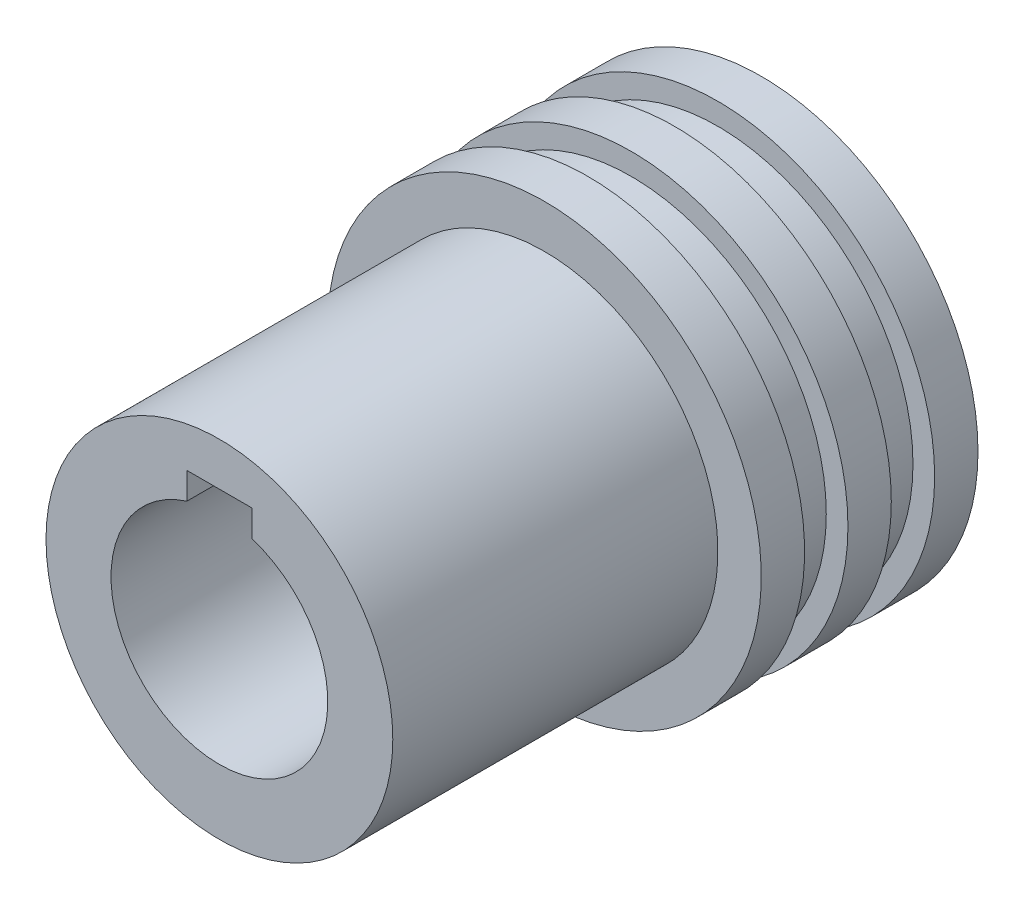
ISO-10303-21;
HEADER;
FILE_DESCRIPTION(('STEP AP214'),'2;1');
FILE_NAME('part.step','',(''),(''),'','','');
FILE_SCHEMA(('AUTOMOTIVE_DESIGN { 1 0 10303 214 1 1 1 1 }'));
ENDSEC;
DATA;
#1=APPLICATION_CONTEXT('core data for automotive mechanical design processes');
#2=APPLICATION_PROTOCOL_DEFINITION('international standard','automotive_design',2000,#1);
#3=PRODUCT_CONTEXT('',#1,'mechanical');
#4=PRODUCT('Part','Part','',(#3));
#5=PRODUCT_RELATED_PRODUCT_CATEGORY('part','',(#4));
#6=PRODUCT_DEFINITION_FORMATION('','',#4);
#7=PRODUCT_DEFINITION_CONTEXT('part definition',#1,'design');
#8=PRODUCT_DEFINITION('design','',#6,#7);
#9=PRODUCT_DEFINITION_SHAPE('','',#8);
#10=(LENGTH_UNIT() NAMED_UNIT(*) SI_UNIT(.MILLI.,.METRE.));
#11=(NAMED_UNIT(*) PLANE_ANGLE_UNIT() SI_UNIT($,.RADIAN.));
#12=(NAMED_UNIT(*) SI_UNIT($,.STERADIAN.) SOLID_ANGLE_UNIT());
#13=UNCERTAINTY_MEASURE_WITH_UNIT(LENGTH_MEASURE(1.E-05),#10,'distance_accuracy_value','');
#14=(GEOMETRIC_REPRESENTATION_CONTEXT(3) GLOBAL_UNCERTAINTY_ASSIGNED_CONTEXT((#13)) GLOBAL_UNIT_ASSIGNED_CONTEXT((#10,
#11,#12)) REPRESENTATION_CONTEXT('',''));
#15=CARTESIAN_POINT('',(0.,0.,0.));
#16=DIRECTION('',(0.,0.,1.));
#17=DIRECTION('',(1.,0.,0.));
#18=AXIS2_PLACEMENT_3D('',#15,#16,#17);
#19=CARTESIAN_POINT('',(0.,0.,-10.));
#20=DIRECTION('',(0.,0.,1.));
#21=DIRECTION('',(1.,0.,0.));
#22=AXIS2_PLACEMENT_3D('',#19,#20,#21);
#23=CYLINDRICAL_SURFACE('',#22,10.);
#24=CARTESIAN_POINT('',(0.,0.,-4.));
#25=DIRECTION('',(0.,0.,1.));
#26=DIRECTION('',(1.,0.,0.));
#27=AXIS2_PLACEMENT_3D('',#24,#25,#26);
#28=CIRCLE('',#27,10.);
#29=CARTESIAN_POINT('',(10.,0.,-4.));
#30=VERTEX_POINT('',#29);
#31=EDGE_CURVE('E115',#30,#30,#28,.T.);
#32=ORIENTED_EDGE('',*,*,#31,.F.);
#33=EDGE_LOOP('',(#32));
#34=FACE_BOUND('',#33,.T.);
#35=CARTESIAN_POINT('',(0.,0.,-6.));
#36=DIRECTION('',(0.,0.,-1.));
#37=DIRECTION('',(-1.,0.,0.));
#38=AXIS2_PLACEMENT_3D('',#35,#36,#37);
#39=CIRCLE('',#38,10.);
#40=CARTESIAN_POINT('',(-10.,0.,-6.));
#41=VERTEX_POINT('',#40);
#42=EDGE_CURVE('E112',#41,#41,#39,.T.);
#43=ORIENTED_EDGE('',*,*,#42,.F.);
#44=EDGE_LOOP('',(#43));
#45=FACE_BOUND('',#44,.T.);
#46=ADVANCED_FACE('F33',(#34,#45),#23,.T.);
#47=CARTESIAN_POINT('',(0.,0.,0.));
#48=DIRECTION('',(0.,0.,-1.));
#49=DIRECTION('',(-1.,0.,0.));
#50=AXIS2_PLACEMENT_3D('',#47,#48,#49);
#51=CIRCLE('',#50,10.);
#52=CARTESIAN_POINT('',(-10.,0.,0.));
#53=VERTEX_POINT('',#52);
#54=EDGE_CURVE('E120',#53,#53,#51,.T.);
#55=ORIENTED_EDGE('',*,*,#54,.T.);
#56=EDGE_LOOP('',(#55));
#57=FACE_BOUND('',#56,.T.);
#58=CARTESIAN_POINT('',(0.,0.,-2.));
#59=DIRECTION('',(0.,0.,-1.));
#60=DIRECTION('',(-1.,0.,0.));
#61=AXIS2_PLACEMENT_3D('',#58,#59,#60);
#62=CIRCLE('',#61,10.);
#63=CARTESIAN_POINT('',(-10.,0.,-2.));
#64=VERTEX_POINT('',#63);
#65=EDGE_CURVE('E123',#64,#64,#62,.T.);
#66=ORIENTED_EDGE('',*,*,#65,.F.);
#67=EDGE_LOOP('',(#66));
#68=FACE_BOUND('',#67,.T.);
#69=ADVANCED_FACE('F158',(#57,#68),#23,.T.);
#70=CARTESIAN_POINT('',(0.,0.,15.));
#71=DIRECTION('',(0.,0.,-1.));
#72=DIRECTION('',(-1.,0.,0.));
#73=AXIS2_PLACEMENT_3D('',#70,#71,#72);
#74=CYLINDRICAL_SURFACE('',#73,8.);
#75=CARTESIAN_POINT('',(0.,0.,15.));
#76=DIRECTION('',(0.,0.,1.));
#77=DIRECTION('',(1.,0.,0.));
#78=AXIS2_PLACEMENT_3D('',#75,#76,#77);
#79=CIRCLE('',#78,8.);
#80=CARTESIAN_POINT('',(8.,0.,15.));
#81=VERTEX_POINT('',#80);
#82=EDGE_CURVE('E126',#81,#81,#79,.T.);
#83=ORIENTED_EDGE('',*,*,#82,.F.);
#84=EDGE_LOOP('',(#83));
#85=FACE_BOUND('',#84,.T.);
#86=CARTESIAN_POINT('',(0.,0.,0.));
#87=DIRECTION('',(0.,0.,-1.));
#88=DIRECTION('',(-1.,0.,0.));
#89=AXIS2_PLACEMENT_3D('',#86,#87,#88);
#90=CIRCLE('',#89,8.);
#91=CARTESIAN_POINT('',(-8.,0.,0.));
#92=VERTEX_POINT('',#91);
#93=EDGE_CURVE('E119',#92,#92,#90,.T.);
#94=ORIENTED_EDGE('',*,*,#93,.F.);
#95=EDGE_LOOP('',(#94));
#96=FACE_BOUND('',#95,.T.);
#97=ADVANCED_FACE('F35',(#85,#96),#74,.T.);
#98=CARTESIAN_POINT('',(0.,0.,15.));
#99=DIRECTION('',(0.,0.,1.));
#100=DIRECTION('',(1.,0.,0.));
#101=AXIS2_PLACEMENT_3D('',#98,#99,#100);
#102=PLANE('',#101);
#103=DIRECTION('',(0.,-1.,0.));
#104=VECTOR('',#103,1.);
#105=CARTESIAN_POINT('',(-1.5,6.,15.));
#106=LINE('',#105,#104);
#107=CARTESIAN_POINT('',(-1.5,6.,15.));
#108=VERTEX_POINT('',#107);
#109=CARTESIAN_POINT('',(-1.5,4.76969600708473,15.));
#110=VERTEX_POINT('',#109);
#111=EDGE_CURVE('E48',#108,#110,#106,.T.);
#112=ORIENTED_EDGE('',*,*,#111,.F.);
#113=DIRECTION('',(-1.,0.,0.));
#114=VECTOR('',#113,1.);
#115=CARTESIAN_POINT('',(-1.5,6.,15.));
#116=LINE('',#115,#114);
#117=CARTESIAN_POINT('',(1.5,6.,15.));
#118=VERTEX_POINT('',#117);
#119=EDGE_CURVE('E92',#118,#108,#116,.T.);
#120=ORIENTED_EDGE('',*,*,#119,.F.);
#121=DIRECTION('',(0.,1.,0.));
#122=VECTOR('',#121,1.);
#123=CARTESIAN_POINT('',(1.5,6.,15.));
#124=LINE('',#123,#122);
#125=CARTESIAN_POINT('',(1.5,4.76969600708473,15.));
#126=VERTEX_POINT('',#125);
#127=EDGE_CURVE('E76',#126,#118,#124,.T.);
#128=ORIENTED_EDGE('',*,*,#127,.F.);
#129=CARTESIAN_POINT('',(0.,0.,15.));
#130=DIRECTION('',(0.,0.,1.));
#131=DIRECTION('',(1.,0.,0.));
#132=AXIS2_PLACEMENT_3D('',#129,#130,#131);
#133=CIRCLE('',#132,5.);
#134=EDGE_CURVE('E85',#110,#126,#133,.T.);
#135=ORIENTED_EDGE('',*,*,#134,.F.);
#136=EDGE_LOOP('',(#112,#120,#128,#135));
#137=FACE_BOUND('',#136,.T.);
#138=ORIENTED_EDGE('',*,*,#82,.T.);
#139=EDGE_LOOP('',(#138));
#140=FACE_BOUND('',#139,.T.);
#141=ADVANCED_FACE('F89',(#137,#140),#102,.T.);
#142=CARTESIAN_POINT('',(0.,0.,0.));
#143=DIRECTION('',(0.,0.,-1.));
#144=DIRECTION('',(-1.,0.,0.));
#145=AXIS2_PLACEMENT_3D('',#142,#143,#144);
#146=PLANE('',#145);
#147=ORIENTED_EDGE('',*,*,#93,.T.);
#148=EDGE_LOOP('',(#147));
#149=FACE_BOUND('',#148,.T.);
#150=ORIENTED_EDGE('',*,*,#54,.F.);
#151=EDGE_LOOP('',(#150));
#152=FACE_BOUND('',#151,.T.);
#153=ADVANCED_FACE('F170',(#149,#152),#146,.F.);
#154=CARTESIAN_POINT('',(0.,10.7259953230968,-2.));
#155=DIRECTION('',(0.,0.,-1.));
#156=DIRECTION('',(-1.,0.,0.));
#157=AXIS2_PLACEMENT_3D('',#154,#155,#156);
#158=PLANE('',#157);
#159=CARTESIAN_POINT('',(0.,0.,-2.));
#160=DIRECTION('',(0.,0.,1.));
#161=DIRECTION('',(1.,0.,0.));
#162=AXIS2_PLACEMENT_3D('',#159,#160,#161);
#163=CIRCLE('',#162,9.);
#164=CARTESIAN_POINT('',(9.,0.,-2.));
#165=VERTEX_POINT('',#164);
#166=EDGE_CURVE('E111',#165,#165,#163,.T.);
#167=ORIENTED_EDGE('',*,*,#166,.T.);
#168=EDGE_LOOP('',(#167));
#169=FACE_BOUND('',#168,.T.);
#170=ORIENTED_EDGE('',*,*,#65,.T.);
#171=EDGE_LOOP('',(#170));
#172=FACE_BOUND('',#171,.T.);
#173=ADVANCED_FACE('F177',(#169,#172),#158,.T.);
#174=CARTESIAN_POINT('',(0.,10.7259953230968,-4.));
#175=DIRECTION('',(0.,0.,1.));
#176=DIRECTION('',(1.,0.,0.));
#177=AXIS2_PLACEMENT_3D('',#174,#175,#176);
#178=PLANE('',#177);
#179=CARTESIAN_POINT('',(0.,0.,-4.));
#180=DIRECTION('',(0.,0.,1.));
#181=DIRECTION('',(1.,0.,0.));
#182=AXIS2_PLACEMENT_3D('',#179,#180,#181);
#183=CIRCLE('',#182,9.);
#184=CARTESIAN_POINT('',(9.,0.,-4.));
#185=VERTEX_POINT('',#184);
#186=EDGE_CURVE('E108',#185,#185,#183,.T.);
#187=ORIENTED_EDGE('',*,*,#186,.F.);
#188=EDGE_LOOP('',(#187));
#189=FACE_BOUND('',#188,.T.);
#190=ORIENTED_EDGE('',*,*,#31,.T.);
#191=EDGE_LOOP('',(#190));
#192=FACE_BOUND('',#191,.T.);
#193=ADVANCED_FACE('F191',(#189,#192),#178,.T.);
#194=CARTESIAN_POINT('',(0.,0.,0.));
#195=DIRECTION('',(0.,0.,1.));
#196=DIRECTION('',(1.,0.,0.));
#197=AXIS2_PLACEMENT_3D('',#194,#195,#196);
#198=CYLINDRICAL_SURFACE('',#197,9.);
#199=ORIENTED_EDGE('',*,*,#186,.T.);
#200=EDGE_LOOP('',(#199));
#201=FACE_BOUND('',#200,.T.);
#202=ORIENTED_EDGE('',*,*,#166,.F.);
#203=EDGE_LOOP('',(#202));
#204=FACE_BOUND('',#203,.T.);
#205=ADVANCED_FACE('F197',(#201,#204),#198,.T.);
#206=CARTESIAN_POINT('',(0.,10.7259953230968,-6.));
#207=DIRECTION('',(0.,0.,-1.));
#208=DIRECTION('',(-1.,0.,0.));
#209=AXIS2_PLACEMENT_3D('',#206,#207,#208);
#210=PLANE('',#209);
#211=CARTESIAN_POINT('',(0.,0.,-6.));
#212=DIRECTION('',(0.,0.,1.));
#213=DIRECTION('',(1.,0.,0.));
#214=AXIS2_PLACEMENT_3D('',#211,#212,#213);
#215=CIRCLE('',#214,9.);
#216=CARTESIAN_POINT('',(9.,0.,-6.));
#217=VERTEX_POINT('',#216);
#218=EDGE_CURVE('E104',#217,#217,#215,.T.);
#219=ORIENTED_EDGE('',*,*,#218,.T.);
#220=EDGE_LOOP('',(#219));
#221=FACE_BOUND('',#220,.T.);
#222=ORIENTED_EDGE('',*,*,#42,.T.);
#223=EDGE_LOOP('',(#222));
#224=FACE_BOUND('',#223,.T.);
#225=ADVANCED_FACE('F212',(#221,#224),#210,.T.);
#226=CARTESIAN_POINT('',(0.,10.7259953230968,-8.));
#227=DIRECTION('',(0.,0.,1.));
#228=DIRECTION('',(1.,0.,0.));
#229=AXIS2_PLACEMENT_3D('',#226,#227,#228);
#230=PLANE('',#229);
#231=CARTESIAN_POINT('',(0.,0.,-8.));
#232=DIRECTION('',(0.,0.,1.));
#233=DIRECTION('',(1.,0.,0.));
#234=AXIS2_PLACEMENT_3D('',#231,#232,#233);
#235=CIRCLE('',#234,9.);
#236=CARTESIAN_POINT('',(9.,0.,-8.));
#237=VERTEX_POINT('',#236);
#238=EDGE_CURVE('E99',#237,#237,#235,.T.);
#239=ORIENTED_EDGE('',*,*,#238,.F.);
#240=EDGE_LOOP('',(#239));
#241=FACE_BOUND('',#240,.T.);
#242=CARTESIAN_POINT('',(0.,0.,-8.));
#243=DIRECTION('',(0.,0.,1.));
#244=DIRECTION('',(1.,0.,0.));
#245=AXIS2_PLACEMENT_3D('',#242,#243,#244);
#246=CIRCLE('',#245,10.);
#247=CARTESIAN_POINT('',(10.,0.,-8.));
#248=VERTEX_POINT('',#247);
#249=EDGE_CURVE('E107',#248,#248,#246,.T.);
#250=ORIENTED_EDGE('',*,*,#249,.T.);
#251=EDGE_LOOP('',(#250));
#252=FACE_BOUND('',#251,.T.);
#253=ADVANCED_FACE('F206',(#241,#252),#230,.T.);
#254=CARTESIAN_POINT('',(0.,0.,0.));
#255=DIRECTION('',(0.,0.,1.));
#256=DIRECTION('',(1.,0.,0.));
#257=AXIS2_PLACEMENT_3D('',#254,#255,#256);
#258=CYLINDRICAL_SURFACE('',#257,9.);
#259=ORIENTED_EDGE('',*,*,#238,.T.);
#260=EDGE_LOOP('',(#259));
#261=FACE_BOUND('',#260,.T.);
#262=ORIENTED_EDGE('',*,*,#218,.F.);
#263=EDGE_LOOP('',(#262));
#264=FACE_BOUND('',#263,.T.);
#265=ADVANCED_FACE('F202',(#261,#264),#258,.T.);
#266=CARTESIAN_POINT('',(0.,0.,-10.));
#267=DIRECTION('',(0.,0.,-1.));
#268=DIRECTION('',(-1.,0.,0.));
#269=AXIS2_PLACEMENT_3D('',#266,#267,#268);
#270=PLANE('',#269);
#271=DIRECTION('',(0.,1.,0.));
#272=VECTOR('',#271,1.);
#273=CARTESIAN_POINT('',(-1.5,0.,-10.));
#274=LINE('',#273,#272);
#275=CARTESIAN_POINT('',(-1.5,4.76969600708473,-10.));
#276=VERTEX_POINT('',#275);
#277=CARTESIAN_POINT('',(-1.5,6.,-10.));
#278=VERTEX_POINT('',#277);
#279=EDGE_CURVE('E11',#276,#278,#274,.T.);
#280=ORIENTED_EDGE('',*,*,#279,.F.);
#281=CARTESIAN_POINT('',(0.,0.,-10.));
#282=DIRECTION('',(0.,0.,-1.));
#283=DIRECTION('',(-1.,0.,0.));
#284=AXIS2_PLACEMENT_3D('',#281,#282,#283);
#285=CIRCLE('',#284,5.);
#286=CARTESIAN_POINT('',(1.5,4.76969600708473,-10.));
#287=VERTEX_POINT('',#286);
#288=EDGE_CURVE('E129',#287,#276,#285,.T.);
#289=ORIENTED_EDGE('',*,*,#288,.F.);
#290=DIRECTION('',(0.,-1.,0.));
#291=VECTOR('',#290,1.);
#292=CARTESIAN_POINT('',(1.5,0.,-10.));
#293=LINE('',#292,#291);
#294=CARTESIAN_POINT('',(1.5,6.,-10.));
#295=VERTEX_POINT('',#294);
#296=EDGE_CURVE('E79',#295,#287,#293,.T.);
#297=ORIENTED_EDGE('',*,*,#296,.F.);
#298=DIRECTION('',(1.,0.,0.));
#299=VECTOR('',#298,1.);
#300=CARTESIAN_POINT('',(0.,6.,-10.));
#301=LINE('',#300,#299);
#302=EDGE_CURVE('E41',#278,#295,#301,.T.);
#303=ORIENTED_EDGE('',*,*,#302,.F.);
#304=EDGE_LOOP('',(#280,#289,#297,#303));
#305=FACE_BOUND('',#304,.T.);
#306=CARTESIAN_POINT('',(0.,0.,-10.));
#307=DIRECTION('',(0.,0.,-1.));
#308=DIRECTION('',(-1.,0.,0.));
#309=AXIS2_PLACEMENT_3D('',#306,#307,#308);
#310=CIRCLE('',#309,10.);
#311=CARTESIAN_POINT('',(-10.,0.,-10.));
#312=VERTEX_POINT('',#311);
#313=EDGE_CURVE('E116',#312,#312,#310,.T.);
#314=ORIENTED_EDGE('',*,*,#313,.T.);
#315=EDGE_LOOP('',(#314));
#316=FACE_BOUND('',#315,.T.);
#317=ADVANCED_FACE('F145',(#305,#316),#270,.T.);
#318=ORIENTED_EDGE('',*,*,#313,.F.);
#319=EDGE_LOOP('',(#318));
#320=FACE_BOUND('',#319,.T.);
#321=ORIENTED_EDGE('',*,*,#249,.F.);
#322=EDGE_LOOP('',(#321));
#323=FACE_BOUND('',#322,.T.);
#324=ADVANCED_FACE('F149',(#320,#323),#23,.T.);
#325=CARTESIAN_POINT('',(-1.5,6.,-11.));
#326=DIRECTION('',(-1.,0.,0.));
#327=DIRECTION('',(0.,-1.,0.));
#328=AXIS2_PLACEMENT_3D('',#325,#326,#327);
#329=PLANE('',#328);
#330=ORIENTED_EDGE('',*,*,#279,.T.);
#331=DIRECTION('',(0.,0.,1.));
#332=VECTOR('',#331,1.);
#333=CARTESIAN_POINT('',(-1.5,6.,-11.));
#334=LINE('',#333,#332);
#335=EDGE_CURVE('E97',#278,#108,#334,.T.);
#336=ORIENTED_EDGE('',*,*,#335,.T.);
#337=ORIENTED_EDGE('',*,*,#111,.T.);
#338=DIRECTION('',(0.,0.,1.));
#339=VECTOR('',#338,1.);
#340=CARTESIAN_POINT('',(-1.5,4.76969600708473,-11.));
#341=LINE('',#340,#339);
#342=EDGE_CURVE('E82',#276,#110,#341,.T.);
#343=ORIENTED_EDGE('',*,*,#342,.F.);
#344=EDGE_LOOP('',(#330,#336,#337,#343));
#345=FACE_BOUND('',#344,.T.);
#346=ADVANCED_FACE('F147',(#345),#329,.F.);
#347=CARTESIAN_POINT('',(-1.5,6.,-11.));
#348=DIRECTION('',(0.,1.,0.));
#349=DIRECTION('',(0.,0.,1.));
#350=AXIS2_PLACEMENT_3D('',#347,#348,#349);
#351=PLANE('',#350);
#352=ORIENTED_EDGE('',*,*,#302,.T.);
#353=DIRECTION('',(0.,0.,1.));
#354=VECTOR('',#353,1.);
#355=CARTESIAN_POINT('',(1.5,6.,-11.));
#356=LINE('',#355,#354);
#357=EDGE_CURVE('E81',#295,#118,#356,.T.);
#358=ORIENTED_EDGE('',*,*,#357,.T.);
#359=ORIENTED_EDGE('',*,*,#119,.T.);
#360=ORIENTED_EDGE('',*,*,#335,.F.);
#361=EDGE_LOOP('',(#352,#358,#359,#360));
#362=FACE_BOUND('',#361,.T.);
#363=ADVANCED_FACE('F142',(#362),#351,.F.);
#364=CARTESIAN_POINT('',(1.5,6.,-11.));
#365=DIRECTION('',(1.,0.,0.));
#366=DIRECTION('',(0.,1.,0.));
#367=AXIS2_PLACEMENT_3D('',#364,#365,#366);
#368=PLANE('',#367);
#369=ORIENTED_EDGE('',*,*,#296,.T.);
#370=DIRECTION('',(0.,0.,1.));
#371=VECTOR('',#370,1.);
#372=CARTESIAN_POINT('',(1.5,4.76969600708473,-11.));
#373=LINE('',#372,#371);
#374=EDGE_CURVE('E56',#287,#126,#373,.T.);
#375=ORIENTED_EDGE('',*,*,#374,.T.);
#376=ORIENTED_EDGE('',*,*,#127,.T.);
#377=ORIENTED_EDGE('',*,*,#357,.F.);
#378=EDGE_LOOP('',(#369,#375,#376,#377));
#379=FACE_BOUND('',#378,.T.);
#380=ADVANCED_FACE('F73',(#379),#368,.F.);
#381=CARTESIAN_POINT('',(0.,0.,-11.));
#382=DIRECTION('',(0.,0.,1.));
#383=DIRECTION('',(1.,0.,0.));
#384=AXIS2_PLACEMENT_3D('',#381,#382,#383);
#385=CYLINDRICAL_SURFACE('',#384,5.);
#386=ORIENTED_EDGE('',*,*,#288,.T.);
#387=ORIENTED_EDGE('',*,*,#342,.T.);
#388=ORIENTED_EDGE('',*,*,#134,.T.);
#389=ORIENTED_EDGE('',*,*,#374,.F.);
#390=EDGE_LOOP('',(#386,#387,#388,#389));
#391=FACE_BOUND('',#390,.T.);
#392=ADVANCED_FACE('F86',(#391),#385,.F.);
#393=CLOSED_SHELL('',(#46,#69,#97,#141,#153,#173,#193,#205,#225,#253,#265,#317,#324,#346,#363,
#380,#392));
#394=MANIFOLD_SOLID_BREP('B2',#393);
#395=ADVANCED_BREP_SHAPE_REPRESENTATION('',(#18,#394),#14);
#396=SHAPE_DEFINITION_REPRESENTATION(#9,#395);
ENDSEC;
END-ISO-10303-21;
